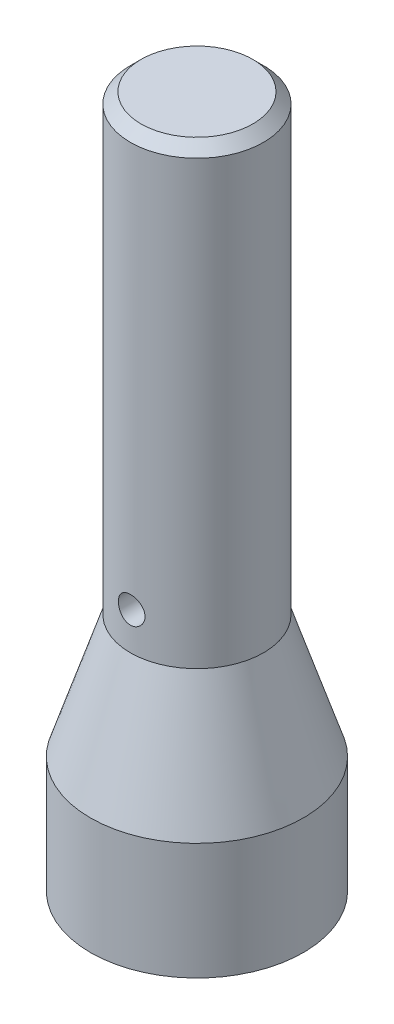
from build123d import *

# Parameters (mm, degrees)
SKETCH1_R                      = 2
BOSS_EXTRUDE1_DEPTH            = 4.5
CHAMFER1_SIZE                  = 2.31
CHAMFER1_SIZE2                 = 0.750564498
SKETCH4_R                      = 1.25
BOSS_EXTRUDE2_DEPTH            = 8.5
F_1_6_1_6_DIAMETER_HOLE2_D     = 1.6
F_1_6_1_6_DIAMETER_HOLE2_DEPTH = 3
F_1_6_1_6_DIAMETER_HOLE2_TIP   = 0.8
F_1_0_1_DIAMETER_HOLE1_D       = 1
F_1_0_1_DIAMETER_HOLE1_DEPTH   = 6
F_1_0_1_DIAMETER_HOLE1_TIP     = 0.5
CHAMFER2_SIZE                  = 0.2


with BuildPart() as part:
    # Sketch1 → Boss-Extrude1 (new body)
    with BuildSketch(Plane(origin=(0, 0, 0), x_dir=(1, 0, 0), z_dir=(0, 1, 0))):
        with Locations(Location((0, 0, 0), (0, 0, 270))):
            Circle(SKETCH1_R)
    extrude(amount=BOSS_EXTRUDE1_DEPTH)

    # Chamfer1
    chamfer1_edges = [part.edges().sort_by_distance(p)[0] for p in [
        (0, 4.5, -2),
    ]]
    chamfer1_side = [part.faces().sort_by_distance(p)[0] for p in [
        (0, 2.25, -2),
    ]]
    chamfer(chamfer1_edges, length=CHAMFER1_SIZE, length2=CHAMFER1_SIZE2, reference=chamfer1_side[0])

    # Sketch4 → Boss-Extrude2 (add)
    with BuildSketch(Plane(origin=(0, 4.5, 0), x_dir=(1, 0, 0), z_dir=(0, 1, 0))):
        with Locations(Location((0, 0, 0), (0, 0, 270))):
            Circle(SKETCH4_R)
    extrude(amount=BOSS_EXTRUDE2_DEPTH)

    # 1.6 _1.6_ Diameter Hole2
    with Locations(Plane(origin=(0, 0, 0), x_dir=(-1, 0, 0), z_dir=(0, -1, 0))):
        with Locations((0, 0)):
            Hole(F_1_6_1_6_DIAMETER_HOLE2_D / 2, depth=F_1_6_1_6_DIAMETER_HOLE2_DEPTH)
            with Locations((0, 0, -(F_1_6_1_6_DIAMETER_HOLE2_DEPTH + F_1_6_1_6_DIAMETER_HOLE2_TIP / 2))):  # 90° drill point
                Cone(0, F_1_6_1_6_DIAMETER_HOLE2_D / 2, F_1_6_1_6_DIAMETER_HOLE2_TIP, mode=Mode.SUBTRACT)

    # 1.0 _1_ Diameter Hole1
    with Locations(Plane(origin=(0, 0, 0), x_dir=(-1, 0, 0), z_dir=(0, -1, 0))):
        with Locations((0, 0)):
            Hole(F_1_0_1_DIAMETER_HOLE1_D / 2, depth=F_1_0_1_DIAMETER_HOLE1_DEPTH)
            with Locations((0, 0, -(F_1_0_1_DIAMETER_HOLE1_DEPTH + F_1_0_1_DIAMETER_HOLE1_TIP / 2))):  # 90° drill point
                Cone(0, F_1_0_1_DIAMETER_HOLE1_D / 2, F_1_0_1_DIAMETER_HOLE1_TIP, mode=Mode.SUBTRACT)

    # Sketch9 → 0.5 _0.5_ Diameter Hole1 (revolve, cut)
    with BuildSketch(Plane(origin=(0, 5.2, 0), x_dir=(0, 1, 0), z_dir=(1, 0, 0))):
        Polygon((0, 0), (0, 6.25), (0.25, 6), (0.25, 0), align=None)
    revolve(axis=Axis((0, 5.2, -6.35), (0, 0, 1)), mode=Mode.SUBTRACT)

    # Chamfer2
    chamfer2_edges = [part.edges().sort_by_distance(p)[0] for p in [
        (0, 13, -1.25),
    ]]
    chamfer(chamfer2_edges, length=CHAMFER2_SIZE)


solid = part.part
